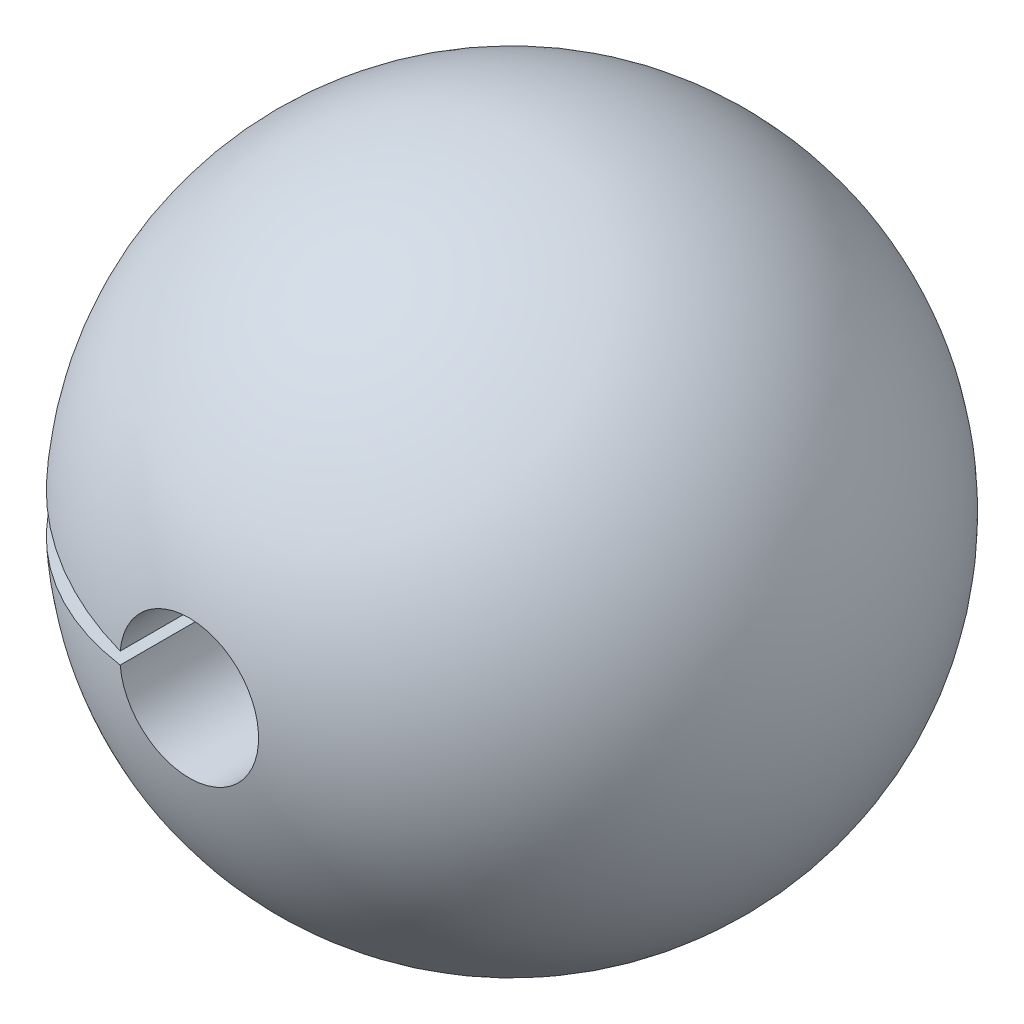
ISO-10303-21;
HEADER;
FILE_DESCRIPTION(('STEP AP214'),'2;1');
FILE_NAME('part.step','',(''),(''),'','','');
FILE_SCHEMA(('AUTOMOTIVE_DESIGN { 1 0 10303 214 1 1 1 1 }'));
ENDSEC;
DATA;
#1=APPLICATION_CONTEXT('core data for automotive mechanical design processes');
#2=APPLICATION_PROTOCOL_DEFINITION('international standard','automotive_design',2000,#1);
#3=PRODUCT_CONTEXT('',#1,'mechanical');
#4=PRODUCT('Part','Part','',(#3));
#5=PRODUCT_RELATED_PRODUCT_CATEGORY('part','',(#4));
#6=PRODUCT_DEFINITION_FORMATION('','',#4);
#7=PRODUCT_DEFINITION_CONTEXT('part definition',#1,'design');
#8=PRODUCT_DEFINITION('design','',#6,#7);
#9=PRODUCT_DEFINITION_SHAPE('','',#8);
#10=(LENGTH_UNIT() NAMED_UNIT(*) SI_UNIT(.MILLI.,.METRE.));
#11=(NAMED_UNIT(*) PLANE_ANGLE_UNIT() SI_UNIT($,.RADIAN.));
#12=(NAMED_UNIT(*) SI_UNIT($,.STERADIAN.) SOLID_ANGLE_UNIT());
#13=UNCERTAINTY_MEASURE_WITH_UNIT(LENGTH_MEASURE(1.E-05),#10,'distance_accuracy_value','');
#14=(GEOMETRIC_REPRESENTATION_CONTEXT(3) GLOBAL_UNCERTAINTY_ASSIGNED_CONTEXT((#13)) GLOBAL_UNIT_ASSIGNED_CONTEXT((#10,
#11,#12)) REPRESENTATION_CONTEXT('',''));
#15=CARTESIAN_POINT('',(0.,0.,0.));
#16=DIRECTION('',(0.,0.,1.));
#17=DIRECTION('',(1.,0.,0.));
#18=AXIS2_PLACEMENT_3D('',#15,#16,#17);
#19=CARTESIAN_POINT('',(0.,0.,0.));
#20=DIRECTION('',(0.,0.,-1.));
#21=DIRECTION('',(1.,0.,0.));
#22=AXIS2_PLACEMENT_3D('',#19,#20,#21);
#23=SPHERICAL_SURFACE('',#22,1431.);
#24=CARTESIAN_POINT('',(0.,0.,-1398.98534659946));
#25=DIRECTION('',(0.,0.,1.));
#26=DIRECTION('',(1.,0.,0.));
#27=AXIS2_PLACEMENT_3D('',#24,#25,#26);
#28=CIRCLE('',#27,301.);
#29=CARTESIAN_POINT('',(-299.854604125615,-26.2338785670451,-1398.98534659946));
#30=VERTEX_POINT('',#29);
#31=CARTESIAN_POINT('',(-299.854604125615,26.2338785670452,-1398.98534659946));
#32=VERTEX_POINT('',#31);
#33=EDGE_CURVE('E66',#30,#32,#28,.T.);
#34=ORIENTED_EDGE('',*,*,#33,.T.);
#35=CARTESIAN_POINT('',(0.,0.,0.));
#36=DIRECTION('',(0.0871557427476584,0.996194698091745,0.));
#37=DIRECTION('',(-0.996194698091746,0.0871557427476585,0.));
#38=AXIS2_PLACEMENT_3D('',#35,#36,#37);
#39=CIRCLE('',#38,1431.);
#40=CARTESIAN_POINT('',(-299.854604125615,26.2338785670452,1398.98534659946));
#41=VERTEX_POINT('',#40);
#42=EDGE_CURVE('E54',#32,#41,#39,.T.);
#43=ORIENTED_EDGE('',*,*,#42,.T.);
#44=CARTESIAN_POINT('',(0.,0.,1398.98534659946));
#45=DIRECTION('',(0.,0.,-1.));
#46=DIRECTION('',(-1.,0.,0.));
#47=AXIS2_PLACEMENT_3D('',#44,#45,#46);
#48=CIRCLE('',#47,301.);
#49=CARTESIAN_POINT('',(-299.854604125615,-26.2338785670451,1398.98534659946));
#50=VERTEX_POINT('',#49);
#51=EDGE_CURVE('E63',#41,#50,#48,.T.);
#52=ORIENTED_EDGE('',*,*,#51,.T.);
#53=CARTESIAN_POINT('',(0.,0.,0.));
#54=DIRECTION('',(0.0871557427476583,-0.996194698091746,0.));
#55=DIRECTION('',(0.996194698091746,0.0871557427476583,0.));
#56=AXIS2_PLACEMENT_3D('',#53,#54,#55);
#57=CIRCLE('',#56,1431.);
#58=EDGE_CURVE('E47',#50,#30,#57,.T.);
#59=ORIENTED_EDGE('',*,*,#58,.T.);
#60=EDGE_LOOP('',(#34,#43,#52,#59));
#61=FACE_BOUND('',#60,.T.);
#62=ADVANCED_FACE('F34',(#61),#23,.T.);
#63=CARTESIAN_POINT('',(0.,0.,-25000.));
#64=DIRECTION('',(0.,0.,1.));
#65=DIRECTION('',(1.,0.,0.));
#66=AXIS2_PLACEMENT_3D('',#63,#64,#65);
#67=CYLINDRICAL_SURFACE('',#66,301.);
#68=ORIENTED_EDGE('',*,*,#51,.F.);
#69=DIRECTION('',(0.,0.,1.));
#70=VECTOR('',#69,1.);
#71=CARTESIAN_POINT('',(-299.854604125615,26.2338785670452,-25000.));
#72=LINE('',#71,#70);
#73=EDGE_CURVE('E11',#41,#32,#72,.F.);
#74=ORIENTED_EDGE('',*,*,#73,.T.);
#75=ORIENTED_EDGE('',*,*,#33,.F.);
#76=DIRECTION('',(0.,0.,1.));
#77=VECTOR('',#76,1.);
#78=CARTESIAN_POINT('',(-299.854604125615,-26.2338785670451,-25000.));
#79=LINE('',#78,#77);
#80=EDGE_CURVE('E41',#30,#50,#79,.T.);
#81=ORIENTED_EDGE('',*,*,#80,.T.);
#82=EDGE_LOOP('',(#68,#74,#75,#81));
#83=FACE_BOUND('',#82,.T.);
#84=ADVANCED_FACE('F68',(#83),#67,.F.);
#85=CARTESIAN_POINT('',(0.,0.,-25000.));
#86=DIRECTION('',(0.0871557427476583,-0.996194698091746,0.));
#87=DIRECTION('',(0.996194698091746,0.0871557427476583,0.));
#88=AXIS2_PLACEMENT_3D('',#85,#86,#87);
#89=PLANE('',#88);
#90=ORIENTED_EDGE('',*,*,#80,.F.);
#91=ORIENTED_EDGE('',*,*,#58,.F.);
#92=EDGE_LOOP('',(#90,#91));
#93=FACE_BOUND('',#92,.T.);
#94=ADVANCED_FACE('F58',(#93),#89,.F.);
#95=CARTESIAN_POINT('',(0.,0.,-25000.));
#96=DIRECTION('',(0.0871557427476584,0.996194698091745,0.));
#97=DIRECTION('',(-0.996194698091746,0.0871557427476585,0.));
#98=AXIS2_PLACEMENT_3D('',#95,#96,#97);
#99=PLANE('',#98);
#100=ORIENTED_EDGE('',*,*,#73,.F.);
#101=ORIENTED_EDGE('',*,*,#42,.F.);
#102=EDGE_LOOP('',(#100,#101));
#103=FACE_BOUND('',#102,.T.);
#104=ADVANCED_FACE('F72',(#103),#99,.F.);
#105=CLOSED_SHELL('',(#62,#84,#94,#104));
#106=MANIFOLD_SOLID_BREP('B2',#105);
#107=ADVANCED_BREP_SHAPE_REPRESENTATION('',(#18,#106),#14);
#108=SHAPE_DEFINITION_REPRESENTATION(#9,#107);
ENDSEC;
END-ISO-10303-21;
